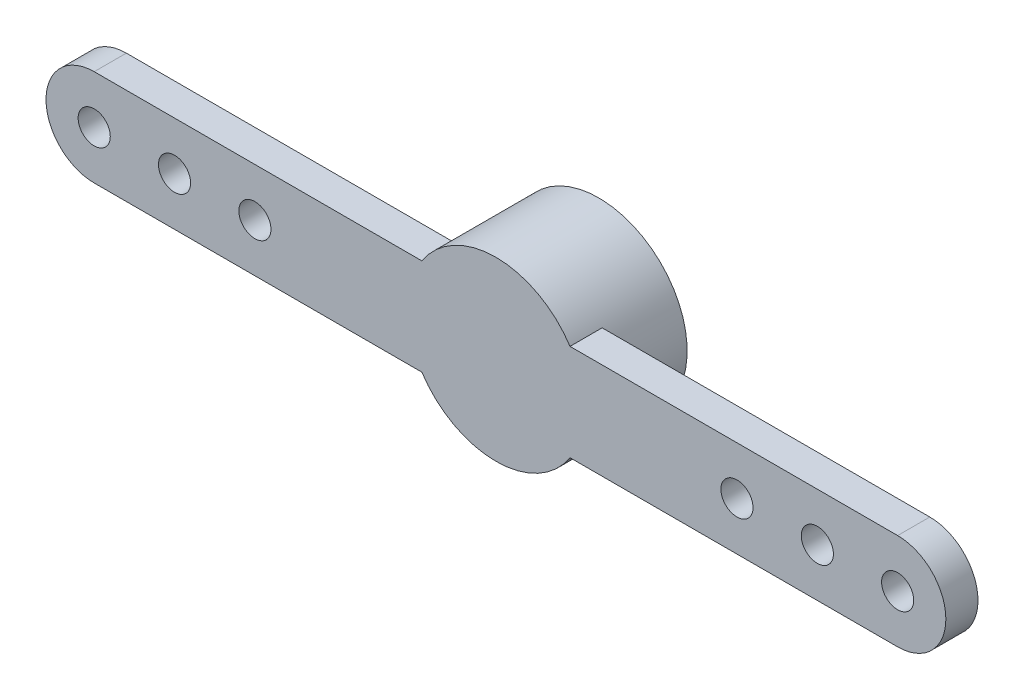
ISO-10303-21;
HEADER;
FILE_DESCRIPTION(('STEP AP214'),'2;1');
FILE_NAME('part.step','',(''),(''),'','','');
FILE_SCHEMA(('AUTOMOTIVE_DESIGN { 1 0 10303 214 1 1 1 1 }'));
ENDSEC;
DATA;
#1=APPLICATION_CONTEXT('core data for automotive mechanical design processes');
#2=APPLICATION_PROTOCOL_DEFINITION('international standard','automotive_design',2000,#1);
#3=PRODUCT_CONTEXT('',#1,'mechanical');
#4=PRODUCT('Part','Part','',(#3));
#5=PRODUCT_RELATED_PRODUCT_CATEGORY('part','',(#4));
#6=PRODUCT_DEFINITION_FORMATION('','',#4);
#7=PRODUCT_DEFINITION_CONTEXT('part definition',#1,'design');
#8=PRODUCT_DEFINITION('design','',#6,#7);
#9=PRODUCT_DEFINITION_SHAPE('','',#8);
#10=(LENGTH_UNIT() NAMED_UNIT(*) SI_UNIT(.MILLI.,.METRE.));
#11=(NAMED_UNIT(*) PLANE_ANGLE_UNIT() SI_UNIT($,.RADIAN.));
#12=(NAMED_UNIT(*) SI_UNIT($,.STERADIAN.) SOLID_ANGLE_UNIT());
#13=UNCERTAINTY_MEASURE_WITH_UNIT(LENGTH_MEASURE(1.E-05),#10,'distance_accuracy_value','');
#14=(GEOMETRIC_REPRESENTATION_CONTEXT(3) GLOBAL_UNCERTAINTY_ASSIGNED_CONTEXT((#13)) GLOBAL_UNIT_ASSIGNED_CONTEXT((#10,
#11,#12)) REPRESENTATION_CONTEXT('',''));
#15=CARTESIAN_POINT('',(0.,0.,0.));
#16=DIRECTION('',(0.,0.,1.));
#17=DIRECTION('',(1.,0.,0.));
#18=AXIS2_PLACEMENT_3D('',#15,#16,#17);
#19=CARTESIAN_POINT('',(-12.5,0.,0.));
#20=DIRECTION('',(0.,0.,1.));
#21=DIRECTION('',(1.,0.,0.));
#22=AXIS2_PLACEMENT_3D('',#19,#20,#21);
#23=PLANE('',#22);
#24=CARTESIAN_POINT('',(-10.,0.,0.));
#25=DIRECTION('',(0.,0.,1.));
#26=DIRECTION('',(1.,0.,0.));
#27=AXIS2_PLACEMENT_3D('',#24,#25,#26);
#28=CIRCLE('',#27,0.500000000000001);
#29=CARTESIAN_POINT('',(-9.5,0.,0.));
#30=VERTEX_POINT('',#29);
#31=EDGE_CURVE('E196',#30,#30,#28,.T.);
#32=ORIENTED_EDGE('',*,*,#31,.T.);
#33=EDGE_LOOP('',(#32));
#34=FACE_BOUND('',#33,.T.);
#35=CARTESIAN_POINT('',(-12.5,0.,0.));
#36=DIRECTION('',(0.,0.,1.));
#37=DIRECTION('',(1.,0.,0.));
#38=AXIS2_PLACEMENT_3D('',#35,#36,#37);
#39=CIRCLE('',#38,0.500000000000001);
#40=CARTESIAN_POINT('',(-12.,0.,0.));
#41=VERTEX_POINT('',#40);
#42=EDGE_CURVE('E202',#41,#41,#39,.T.);
#43=ORIENTED_EDGE('',*,*,#42,.T.);
#44=EDGE_LOOP('',(#43));
#45=FACE_BOUND('',#44,.T.);
#46=CARTESIAN_POINT('',(-7.5,0.,0.));
#47=DIRECTION('',(0.,0.,1.));
#48=DIRECTION('',(1.,0.,0.));
#49=AXIS2_PLACEMENT_3D('',#46,#47,#48);
#50=CIRCLE('',#49,0.500000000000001);
#51=CARTESIAN_POINT('',(-7.,0.,0.));
#52=VERTEX_POINT('',#51);
#53=EDGE_CURVE('E190',#52,#52,#50,.T.);
#54=ORIENTED_EDGE('',*,*,#53,.T.);
#55=EDGE_LOOP('',(#54));
#56=FACE_BOUND('',#55,.T.);
#57=DIRECTION('',(-1.,0.,0.));
#58=VECTOR('',#57,1.);
#59=CARTESIAN_POINT('',(12.5,1.5,0.));
#60=LINE('',#59,#58);
#61=CARTESIAN_POINT('',(-2.30488611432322,1.5,0.));
#62=VERTEX_POINT('',#61);
#63=CARTESIAN_POINT('',(-12.5,1.5,0.));
#64=VERTEX_POINT('',#63);
#65=EDGE_CURVE('E78',#62,#64,#60,.T.);
#66=ORIENTED_EDGE('',*,*,#65,.F.);
#67=CARTESIAN_POINT('',(0.,0.,0.));
#68=DIRECTION('',(0.,0.,1.));
#69=DIRECTION('',(1.,0.,0.));
#70=AXIS2_PLACEMENT_3D('',#67,#68,#69);
#71=CIRCLE('',#70,2.75);
#72=CARTESIAN_POINT('',(-2.30488611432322,-1.5,0.));
#73=VERTEX_POINT('',#72);
#74=EDGE_CURVE('E116',#62,#73,#71,.T.);
#75=ORIENTED_EDGE('',*,*,#74,.T.);
#76=DIRECTION('',(1.,0.,0.));
#77=VECTOR('',#76,1.);
#78=CARTESIAN_POINT('',(-12.5,-1.5,0.));
#79=LINE('',#78,#77);
#80=CARTESIAN_POINT('',(-12.5,-1.5,0.));
#81=VERTEX_POINT('',#80);
#82=EDGE_CURVE('E144',#81,#73,#79,.T.);
#83=ORIENTED_EDGE('',*,*,#82,.F.);
#84=CARTESIAN_POINT('',(-12.5,0.,0.));
#85=DIRECTION('',(0.,0.,1.));
#86=DIRECTION('',(1.,0.,0.));
#87=AXIS2_PLACEMENT_3D('',#84,#85,#86);
#88=CIRCLE('',#87,1.5);
#89=EDGE_CURVE('E139',#64,#81,#88,.T.);
#90=ORIENTED_EDGE('',*,*,#89,.F.);
#91=EDGE_LOOP('',(#66,#75,#83,#90));
#92=FACE_BOUND('',#91,.T.);
#93=ADVANCED_FACE('F34',(#34,#45,#56,#92),#23,.F.);
#94=CARTESIAN_POINT('',(-12.5,-1.5,1.));
#95=DIRECTION('',(0.,1.,0.));
#96=DIRECTION('',(0.,0.,1.));
#97=AXIS2_PLACEMENT_3D('',#94,#95,#96);
#98=PLANE('',#97);
#99=DIRECTION('',(1.,0.,0.));
#100=VECTOR('',#99,1.);
#101=CARTESIAN_POINT('',(-12.5,-1.5,1.));
#102=LINE('',#101,#100);
#103=CARTESIAN_POINT('',(2.30488611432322,-1.5,1.));
#104=VERTEX_POINT('',#103);
#105=CARTESIAN_POINT('',(12.5,-1.5,1.));
#106=VERTEX_POINT('',#105);
#107=EDGE_CURVE('E121',#104,#106,#102,.T.);
#108=ORIENTED_EDGE('',*,*,#107,.F.);
#109=DIRECTION('',(0.,0.,-1.));
#110=VECTOR('',#109,1.);
#111=CARTESIAN_POINT('',(2.30488611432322,-1.5,8.77817459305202));
#112=LINE('',#111,#110);
#113=CARTESIAN_POINT('',(2.30488611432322,-1.5,0.));
#114=VERTEX_POINT('',#113);
#115=EDGE_CURVE('E107',#104,#114,#112,.T.);
#116=ORIENTED_EDGE('',*,*,#115,.T.);
#117=CARTESIAN_POINT('',(12.5,-1.5,0.));
#118=VERTEX_POINT('',#117);
#119=EDGE_CURVE('E142',#114,#118,#79,.T.);
#120=ORIENTED_EDGE('',*,*,#119,.T.);
#121=DIRECTION('',(0.,0.,-1.));
#122=VECTOR('',#121,1.);
#123=CARTESIAN_POINT('',(12.5,-1.5,1.));
#124=LINE('',#123,#122);
#125=EDGE_CURVE('E126',#106,#118,#124,.T.);
#126=ORIENTED_EDGE('',*,*,#125,.F.);
#127=EDGE_LOOP('',(#108,#116,#120,#126));
#128=FACE_BOUND('',#127,.T.);
#129=ADVANCED_FACE('F124',(#128),#98,.F.);
#130=CARTESIAN_POINT('',(12.5,1.5,1.));
#131=DIRECTION('',(0.,-1.,0.));
#132=DIRECTION('',(1.,0.,0.));
#133=AXIS2_PLACEMENT_3D('',#130,#131,#132);
#134=PLANE('',#133);
#135=DIRECTION('',(-1.,0.,0.));
#136=VECTOR('',#135,1.);
#137=CARTESIAN_POINT('',(12.5,1.5,1.));
#138=LINE('',#137,#136);
#139=CARTESIAN_POINT('',(-2.30488611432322,1.5,1.));
#140=VERTEX_POINT('',#139);
#141=CARTESIAN_POINT('',(-12.5,1.5,1.));
#142=VERTEX_POINT('',#141);
#143=EDGE_CURVE('E57',#140,#142,#138,.T.);
#144=ORIENTED_EDGE('',*,*,#143,.F.);
#145=DIRECTION('',(0.,0.,-1.));
#146=VECTOR('',#145,1.);
#147=CARTESIAN_POINT('',(-2.30488611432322,1.5,8.77817459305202));
#148=LINE('',#147,#146);
#149=EDGE_CURVE('E11',#140,#62,#148,.T.);
#150=ORIENTED_EDGE('',*,*,#149,.T.);
#151=ORIENTED_EDGE('',*,*,#65,.T.);
#152=DIRECTION('',(0.,0.,-1.));
#153=VECTOR('',#152,1.);
#154=CARTESIAN_POINT('',(-12.5,1.5,1.));
#155=LINE('',#154,#153);
#156=EDGE_CURVE('E138',#142,#64,#155,.T.);
#157=ORIENTED_EDGE('',*,*,#156,.F.);
#158=EDGE_LOOP('',(#144,#150,#151,#157));
#159=FACE_BOUND('',#158,.T.);
#160=ADVANCED_FACE('F224',(#159),#134,.F.);
#161=CARTESIAN_POINT('',(-12.5,0.,1.));
#162=DIRECTION('',(0.,0.,1.));
#163=DIRECTION('',(1.,0.,0.));
#164=AXIS2_PLACEMENT_3D('',#161,#162,#163);
#165=PLANE('',#164);
#166=CARTESIAN_POINT('',(12.5,1.5,1.));
#167=VERTEX_POINT('',#166);
#168=CARTESIAN_POINT('',(2.30488611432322,1.5,1.));
#169=VERTEX_POINT('',#168);
#170=EDGE_CURVE('E136',#167,#169,#138,.T.);
#171=ORIENTED_EDGE('',*,*,#170,.T.);
#172=CARTESIAN_POINT('',(0.,0.,1.));
#173=DIRECTION('',(0.,0.,1.));
#174=DIRECTION('',(1.,0.,0.));
#175=AXIS2_PLACEMENT_3D('',#172,#173,#174);
#176=CIRCLE('',#175,2.75);
#177=EDGE_CURVE('E49',#140,#169,#176,.F.);
#178=ORIENTED_EDGE('',*,*,#177,.F.);
#179=ORIENTED_EDGE('',*,*,#143,.T.);
#180=CARTESIAN_POINT('',(-12.5,0.,1.));
#181=DIRECTION('',(0.,0.,1.));
#182=DIRECTION('',(1.,0.,0.));
#183=AXIS2_PLACEMENT_3D('',#180,#181,#182);
#184=CIRCLE('',#183,1.5);
#185=CARTESIAN_POINT('',(-12.5,-1.5,1.));
#186=VERTEX_POINT('',#185);
#187=EDGE_CURVE('E128',#142,#186,#184,.T.);
#188=ORIENTED_EDGE('',*,*,#187,.T.);
#189=CARTESIAN_POINT('',(-2.30488611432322,-1.5,1.));
#190=VERTEX_POINT('',#189);
#191=EDGE_CURVE('E86',#186,#190,#102,.T.);
#192=ORIENTED_EDGE('',*,*,#191,.T.);
#193=EDGE_CURVE('E110',#104,#190,#176,.F.);
#194=ORIENTED_EDGE('',*,*,#193,.F.);
#195=ORIENTED_EDGE('',*,*,#107,.T.);
#196=CARTESIAN_POINT('',(12.5,0.,1.));
#197=DIRECTION('',(0.,0.,1.));
#198=DIRECTION('',(1.,0.,0.));
#199=AXIS2_PLACEMENT_3D('',#196,#197,#198);
#200=CIRCLE('',#199,1.5);
#201=EDGE_CURVE('E130',#106,#167,#200,.T.);
#202=ORIENTED_EDGE('',*,*,#201,.T.);
#203=EDGE_LOOP('',(#171,#178,#179,#188,#192,#194,#195,#202));
#204=FACE_BOUND('',#203,.T.);
#205=CARTESIAN_POINT('',(10.,0.,1.));
#206=DIRECTION('',(0.,0.,1.));
#207=DIRECTION('',(1.,0.,0.));
#208=AXIS2_PLACEMENT_3D('',#205,#206,#207);
#209=CIRCLE('',#208,0.500000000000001);
#210=CARTESIAN_POINT('',(10.5,0.,1.));
#211=VERTEX_POINT('',#210);
#212=EDGE_CURVE('E181',#211,#211,#209,.T.);
#213=ORIENTED_EDGE('',*,*,#212,.F.);
#214=EDGE_LOOP('',(#213));
#215=FACE_BOUND('',#214,.T.);
#216=CARTESIAN_POINT('',(7.5,0.,1.));
#217=DIRECTION('',(0.,0.,1.));
#218=DIRECTION('',(1.,0.,0.));
#219=AXIS2_PLACEMENT_3D('',#216,#217,#218);
#220=CIRCLE('',#219,0.500000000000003);
#221=CARTESIAN_POINT('',(8.,0.,1.));
#222=VERTEX_POINT('',#221);
#223=EDGE_CURVE('E187',#222,#222,#220,.T.);
#224=ORIENTED_EDGE('',*,*,#223,.F.);
#225=EDGE_LOOP('',(#224));
#226=FACE_BOUND('',#225,.T.);
#227=CARTESIAN_POINT('',(12.5,0.,1.));
#228=DIRECTION('',(0.,0.,1.));
#229=DIRECTION('',(1.,0.,0.));
#230=AXIS2_PLACEMENT_3D('',#227,#228,#229);
#231=CIRCLE('',#230,0.500000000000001);
#232=CARTESIAN_POINT('',(13.,0.,1.));
#233=VERTEX_POINT('',#232);
#234=EDGE_CURVE('E175',#233,#233,#231,.T.);
#235=ORIENTED_EDGE('',*,*,#234,.F.);
#236=EDGE_LOOP('',(#235));
#237=FACE_BOUND('',#236,.T.);
#238=CARTESIAN_POINT('',(-10.,0.,1.));
#239=DIRECTION('',(0.,0.,1.));
#240=DIRECTION('',(1.,0.,0.));
#241=AXIS2_PLACEMENT_3D('',#238,#239,#240);
#242=CIRCLE('',#241,0.500000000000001);
#243=CARTESIAN_POINT('',(-9.5,0.,1.));
#244=VERTEX_POINT('',#243);
#245=EDGE_CURVE('E199',#244,#244,#242,.T.);
#246=ORIENTED_EDGE('',*,*,#245,.F.);
#247=EDGE_LOOP('',(#246));
#248=FACE_BOUND('',#247,.T.);
#249=CARTESIAN_POINT('',(-12.5,0.,1.));
#250=DIRECTION('',(0.,0.,1.));
#251=DIRECTION('',(1.,0.,0.));
#252=AXIS2_PLACEMENT_3D('',#249,#250,#251);
#253=CIRCLE('',#252,0.500000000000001);
#254=CARTESIAN_POINT('',(-12.,0.,1.));
#255=VERTEX_POINT('',#254);
#256=EDGE_CURVE('E143',#255,#255,#253,.T.);
#257=ORIENTED_EDGE('',*,*,#256,.F.);
#258=EDGE_LOOP('',(#257));
#259=FACE_BOUND('',#258,.T.);
#260=CARTESIAN_POINT('',(-7.5,0.,1.));
#261=DIRECTION('',(0.,0.,1.));
#262=DIRECTION('',(1.,0.,0.));
#263=AXIS2_PLACEMENT_3D('',#260,#261,#262);
#264=CIRCLE('',#263,0.500000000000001);
#265=CARTESIAN_POINT('',(-7.,0.,1.));
#266=VERTEX_POINT('',#265);
#267=EDGE_CURVE('E193',#266,#266,#264,.T.);
#268=ORIENTED_EDGE('',*,*,#267,.F.);
#269=EDGE_LOOP('',(#268));
#270=FACE_BOUND('',#269,.T.);
#271=ADVANCED_FACE('F119',(#204,#215,#226,#237,#248,#259,#270),#165,.T.);
#272=CARTESIAN_POINT('',(10.,0.,0.));
#273=DIRECTION('',(0.,0.,1.));
#274=DIRECTION('',(1.,0.,0.));
#275=AXIS2_PLACEMENT_3D('',#272,#273,#274);
#276=CIRCLE('',#275,0.500000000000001);
#277=CARTESIAN_POINT('',(10.5,0.,0.));
#278=VERTEX_POINT('',#277);
#279=EDGE_CURVE('E179',#278,#278,#276,.T.);
#280=ORIENTED_EDGE('',*,*,#279,.T.);
#281=EDGE_LOOP('',(#280));
#282=FACE_BOUND('',#281,.T.);
#283=ORIENTED_EDGE('',*,*,#119,.F.);
#284=CARTESIAN_POINT('',(2.30488611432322,1.5,0.));
#285=VERTEX_POINT('',#284);
#286=EDGE_CURVE('E112',#114,#285,#71,.T.);
#287=ORIENTED_EDGE('',*,*,#286,.T.);
#288=CARTESIAN_POINT('',(12.5,1.5,0.));
#289=VERTEX_POINT('',#288);
#290=EDGE_CURVE('E131',#289,#285,#60,.T.);
#291=ORIENTED_EDGE('',*,*,#290,.F.);
#292=CARTESIAN_POINT('',(12.5,0.,0.));
#293=DIRECTION('',(0.,0.,1.));
#294=DIRECTION('',(1.,0.,0.));
#295=AXIS2_PLACEMENT_3D('',#292,#293,#294);
#296=CIRCLE('',#295,1.5);
#297=EDGE_CURVE('E147',#118,#289,#296,.T.);
#298=ORIENTED_EDGE('',*,*,#297,.F.);
#299=EDGE_LOOP('',(#283,#287,#291,#298));
#300=FACE_BOUND('',#299,.T.);
#301=CARTESIAN_POINT('',(7.5,0.,0.));
#302=DIRECTION('',(0.,0.,1.));
#303=DIRECTION('',(1.,0.,0.));
#304=AXIS2_PLACEMENT_3D('',#301,#302,#303);
#305=CIRCLE('',#304,0.500000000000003);
#306=CARTESIAN_POINT('',(8.,0.,0.));
#307=VERTEX_POINT('',#306);
#308=EDGE_CURVE('E184',#307,#307,#305,.T.);
#309=ORIENTED_EDGE('',*,*,#308,.T.);
#310=EDGE_LOOP('',(#309));
#311=FACE_BOUND('',#310,.T.);
#312=CARTESIAN_POINT('',(12.5,0.,0.));
#313=DIRECTION('',(0.,0.,1.));
#314=DIRECTION('',(1.,0.,0.));
#315=AXIS2_PLACEMENT_3D('',#312,#313,#314);
#316=CIRCLE('',#315,0.500000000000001);
#317=CARTESIAN_POINT('',(13.,0.,0.));
#318=VERTEX_POINT('',#317);
#319=EDGE_CURVE('E172',#318,#318,#316,.T.);
#320=ORIENTED_EDGE('',*,*,#319,.T.);
#321=EDGE_LOOP('',(#320));
#322=FACE_BOUND('',#321,.T.);
#323=ADVANCED_FACE('F166',(#282,#300,#311,#322),#23,.F.);
#324=CARTESIAN_POINT('',(-12.5,0.,1.));
#325=DIRECTION('',(0.,0.,-1.));
#326=DIRECTION('',(-1.,0.,0.));
#327=AXIS2_PLACEMENT_3D('',#324,#325,#326);
#328=CYLINDRICAL_SURFACE('',#327,1.5);
#329=ORIENTED_EDGE('',*,*,#89,.T.);
#330=DIRECTION('',(0.,0.,-1.));
#331=VECTOR('',#330,1.);
#332=CARTESIAN_POINT('',(-12.5,-1.5,1.));
#333=LINE('',#332,#331);
#334=EDGE_CURVE('E156',#186,#81,#333,.T.);
#335=ORIENTED_EDGE('',*,*,#334,.F.);
#336=ORIENTED_EDGE('',*,*,#187,.F.);
#337=ORIENTED_EDGE('',*,*,#156,.T.);
#338=EDGE_LOOP('',(#329,#335,#336,#337));
#339=FACE_BOUND('',#338,.T.);
#340=ADVANCED_FACE('F36',(#339),#328,.T.);
#341=ORIENTED_EDGE('',*,*,#82,.T.);
#342=DIRECTION('',(0.,0.,-1.));
#343=VECTOR('',#342,1.);
#344=CARTESIAN_POINT('',(-2.30488611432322,-1.5,8.77817459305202));
#345=LINE('',#344,#343);
#346=EDGE_CURVE('E170',#73,#190,#345,.F.);
#347=ORIENTED_EDGE('',*,*,#346,.T.);
#348=ORIENTED_EDGE('',*,*,#191,.F.);
#349=ORIENTED_EDGE('',*,*,#334,.T.);
#350=EDGE_LOOP('',(#341,#347,#348,#349));
#351=FACE_BOUND('',#350,.T.);
#352=ADVANCED_FACE('F232',(#351),#98,.F.);
#353=CARTESIAN_POINT('',(12.5,0.,1.));
#354=DIRECTION('',(0.,0.,-1.));
#355=DIRECTION('',(-1.,0.,0.));
#356=AXIS2_PLACEMENT_3D('',#353,#354,#355);
#357=CYLINDRICAL_SURFACE('',#356,1.5);
#358=ORIENTED_EDGE('',*,*,#297,.T.);
#359=DIRECTION('',(0.,0.,-1.));
#360=VECTOR('',#359,1.);
#361=CARTESIAN_POINT('',(12.5,1.5,1.));
#362=LINE('',#361,#360);
#363=EDGE_CURVE('E152',#167,#289,#362,.T.);
#364=ORIENTED_EDGE('',*,*,#363,.F.);
#365=ORIENTED_EDGE('',*,*,#201,.F.);
#366=ORIENTED_EDGE('',*,*,#125,.T.);
#367=EDGE_LOOP('',(#358,#364,#365,#366));
#368=FACE_BOUND('',#367,.T.);
#369=ADVANCED_FACE('F163',(#368),#357,.T.);
#370=ORIENTED_EDGE('',*,*,#290,.T.);
#371=DIRECTION('',(0.,0.,-1.));
#372=VECTOR('',#371,1.);
#373=CARTESIAN_POINT('',(2.30488611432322,1.5,8.77817459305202));
#374=LINE('',#373,#372);
#375=EDGE_CURVE('E42',#285,#169,#374,.F.);
#376=ORIENTED_EDGE('',*,*,#375,.T.);
#377=ORIENTED_EDGE('',*,*,#170,.F.);
#378=ORIENTED_EDGE('',*,*,#363,.T.);
#379=EDGE_LOOP('',(#370,#376,#377,#378));
#380=FACE_BOUND('',#379,.T.);
#381=ADVANCED_FACE('F159',(#380),#134,.F.);
#382=CARTESIAN_POINT('',(-12.5,0.,1.));
#383=DIRECTION('',(0.,0.,-1.));
#384=DIRECTION('',(-1.,0.,0.));
#385=AXIS2_PLACEMENT_3D('',#382,#383,#384);
#386=CYLINDRICAL_SURFACE('',#385,0.500000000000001);
#387=ORIENTED_EDGE('',*,*,#256,.T.);
#388=EDGE_LOOP('',(#387));
#389=FACE_BOUND('',#388,.T.);
#390=ORIENTED_EDGE('',*,*,#42,.F.);
#391=EDGE_LOOP('',(#390));
#392=FACE_BOUND('',#391,.T.);
#393=ADVANCED_FACE('F211',(#389,#392),#386,.F.);
#394=CARTESIAN_POINT('',(-10.,0.,1.));
#395=DIRECTION('',(0.,0.,-1.));
#396=DIRECTION('',(-1.,0.,0.));
#397=AXIS2_PLACEMENT_3D('',#394,#395,#396);
#398=CYLINDRICAL_SURFACE('',#397,0.500000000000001);
#399=ORIENTED_EDGE('',*,*,#245,.T.);
#400=EDGE_LOOP('',(#399));
#401=FACE_BOUND('',#400,.T.);
#402=ORIENTED_EDGE('',*,*,#31,.F.);
#403=EDGE_LOOP('',(#402));
#404=FACE_BOUND('',#403,.T.);
#405=ADVANCED_FACE('F213',(#401,#404),#398,.F.);
#406=CARTESIAN_POINT('',(-7.5,0.,1.));
#407=DIRECTION('',(0.,0.,-1.));
#408=DIRECTION('',(-1.,0.,0.));
#409=AXIS2_PLACEMENT_3D('',#406,#407,#408);
#410=CYLINDRICAL_SURFACE('',#409,0.500000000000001);
#411=ORIENTED_EDGE('',*,*,#267,.T.);
#412=EDGE_LOOP('',(#411));
#413=FACE_BOUND('',#412,.T.);
#414=ORIENTED_EDGE('',*,*,#53,.F.);
#415=EDGE_LOOP('',(#414));
#416=FACE_BOUND('',#415,.T.);
#417=ADVANCED_FACE('F220',(#413,#416),#410,.F.);
#418=CARTESIAN_POINT('',(7.5,0.,1.));
#419=DIRECTION('',(0.,0.,-1.));
#420=DIRECTION('',(-1.,0.,0.));
#421=AXIS2_PLACEMENT_3D('',#418,#419,#420);
#422=CYLINDRICAL_SURFACE('',#421,0.500000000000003);
#423=ORIENTED_EDGE('',*,*,#223,.T.);
#424=EDGE_LOOP('',(#423));
#425=FACE_BOUND('',#424,.T.);
#426=ORIENTED_EDGE('',*,*,#308,.F.);
#427=EDGE_LOOP('',(#426));
#428=FACE_BOUND('',#427,.T.);
#429=ADVANCED_FACE('F245',(#425,#428),#422,.F.);
#430=CARTESIAN_POINT('',(10.,0.,1.));
#431=DIRECTION('',(0.,0.,-1.));
#432=DIRECTION('',(-1.,0.,0.));
#433=AXIS2_PLACEMENT_3D('',#430,#431,#432);
#434=CYLINDRICAL_SURFACE('',#433,0.500000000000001);
#435=ORIENTED_EDGE('',*,*,#212,.T.);
#436=EDGE_LOOP('',(#435));
#437=FACE_BOUND('',#436,.T.);
#438=ORIENTED_EDGE('',*,*,#279,.F.);
#439=EDGE_LOOP('',(#438));
#440=FACE_BOUND('',#439,.T.);
#441=ADVANCED_FACE('F242',(#437,#440),#434,.F.);
#442=CARTESIAN_POINT('',(12.5,0.,1.));
#443=DIRECTION('',(0.,0.,-1.));
#444=DIRECTION('',(-1.,0.,0.));
#445=AXIS2_PLACEMENT_3D('',#442,#443,#444);
#446=CYLINDRICAL_SURFACE('',#445,0.500000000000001);
#447=ORIENTED_EDGE('',*,*,#234,.T.);
#448=EDGE_LOOP('',(#447));
#449=FACE_BOUND('',#448,.T.);
#450=ORIENTED_EDGE('',*,*,#319,.F.);
#451=EDGE_LOOP('',(#450));
#452=FACE_BOUND('',#451,.T.);
#453=ADVANCED_FACE('F244',(#449,#452),#446,.F.);
#454=CARTESIAN_POINT('',(0.,0.,8.77817459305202));
#455=DIRECTION('',(0.,0.,-1.));
#456=DIRECTION('',(-1.,0.,0.));
#457=AXIS2_PLACEMENT_3D('',#454,#455,#456);
#458=CYLINDRICAL_SURFACE('',#457,2.75);
#459=CARTESIAN_POINT('',(0.,0.,-2.2));
#460=DIRECTION('',(0.,0.,-1.));
#461=DIRECTION('',(-1.,0.,0.));
#462=AXIS2_PLACEMENT_3D('',#459,#460,#461);
#463=CIRCLE('',#462,2.75);
#464=CARTESIAN_POINT('',(-2.75,0.,-2.2));
#465=VERTEX_POINT('',#464);
#466=EDGE_CURVE('E333',#465,#465,#463,.T.);
#467=ORIENTED_EDGE('',*,*,#466,.F.);
#468=EDGE_LOOP('',(#467));
#469=FACE_BOUND('',#468,.T.);
#470=ORIENTED_EDGE('',*,*,#346,.F.);
#471=ORIENTED_EDGE('',*,*,#74,.F.);
#472=ORIENTED_EDGE('',*,*,#149,.F.);
#473=ORIENTED_EDGE('',*,*,#177,.T.);
#474=ORIENTED_EDGE('',*,*,#375,.F.);
#475=ORIENTED_EDGE('',*,*,#286,.F.);
#476=ORIENTED_EDGE('',*,*,#115,.F.);
#477=ORIENTED_EDGE('',*,*,#193,.T.);
#478=EDGE_LOOP('',(#470,#471,#472,#473,#474,#475,#476,#477));
#479=FACE_BOUND('',#478,.T.);
#480=ADVANCED_FACE('F109',(#469,#479),#458,.T.);
#481=CARTESIAN_POINT('',(0.,0.,-2.2));
#482=DIRECTION('',(0.,0.,-1.));
#483=DIRECTION('',(-1.,0.,0.));
#484=AXIS2_PLACEMENT_3D('',#481,#482,#483);
#485=PLANE('',#484);
#486=CARTESIAN_POINT('',(0.,0.,-2.2));
#487=DIRECTION('',(0.,0.,-1.));
#488=DIRECTION('',(-1.,0.,0.));
#489=AXIS2_PLACEMENT_3D('',#486,#487,#488);
#490=CIRCLE('',#489,2.);
#491=CARTESIAN_POINT('',(-2.,0.,-2.2));
#492=VERTEX_POINT('',#491);
#493=EDGE_CURVE('E334',#492,#492,#490,.T.);
#494=ORIENTED_EDGE('',*,*,#493,.F.);
#495=EDGE_LOOP('',(#494));
#496=FACE_BOUND('',#495,.T.);
#497=ORIENTED_EDGE('',*,*,#466,.T.);
#498=EDGE_LOOP('',(#497));
#499=FACE_BOUND('',#498,.T.);
#500=ADVANCED_FACE('F296',(#496,#499),#485,.T.);
#501=CARTESIAN_POINT('',(0.,0.,0.4));
#502=DIRECTION('',(0.,0.,-1.));
#503=DIRECTION('',(-1.,0.,0.));
#504=AXIS2_PLACEMENT_3D('',#501,#502,#503);
#505=CYLINDRICAL_SURFACE('',#504,2.);
#506=CARTESIAN_POINT('',(0.,0.,0.4));
#507=DIRECTION('',(0.,0.,-1.));
#508=DIRECTION('',(-1.,0.,0.));
#509=AXIS2_PLACEMENT_3D('',#506,#507,#508);
#510=CIRCLE('',#509,2.);
#511=CARTESIAN_POINT('',(-2.,0.,0.4));
#512=VERTEX_POINT('',#511);
#513=EDGE_CURVE('E332',#512,#512,#510,.T.);
#514=ORIENTED_EDGE('',*,*,#513,.F.);
#515=EDGE_LOOP('',(#514));
#516=FACE_BOUND('',#515,.T.);
#517=ORIENTED_EDGE('',*,*,#493,.T.);
#518=EDGE_LOOP('',(#517));
#519=FACE_BOUND('',#518,.T.);
#520=ADVANCED_FACE('F306',(#516,#519),#505,.F.);
#521=CARTESIAN_POINT('',(0.,0.,0.4));
#522=DIRECTION('',(0.,0.,-1.));
#523=DIRECTION('',(-1.,0.,0.));
#524=AXIS2_PLACEMENT_3D('',#521,#522,#523);
#525=PLANE('',#524);
#526=ORIENTED_EDGE('',*,*,#513,.T.);
#527=EDGE_LOOP('',(#526));
#528=FACE_BOUND('',#527,.T.);
#529=ADVANCED_FACE('F316',(#528),#525,.T.);
#530=CLOSED_SHELL('',(#93,#129,#160,#271,#323,#340,#352,#369,#381,#393,#405,#417,#429,#441,#453,
#480,#500,#520,#529));
#531=MANIFOLD_SOLID_BREP('B2',#530);
#532=ADVANCED_BREP_SHAPE_REPRESENTATION('',(#18,#531),#14);
#533=SHAPE_DEFINITION_REPRESENTATION(#9,#532);
ENDSEC;
END-ISO-10303-21;
